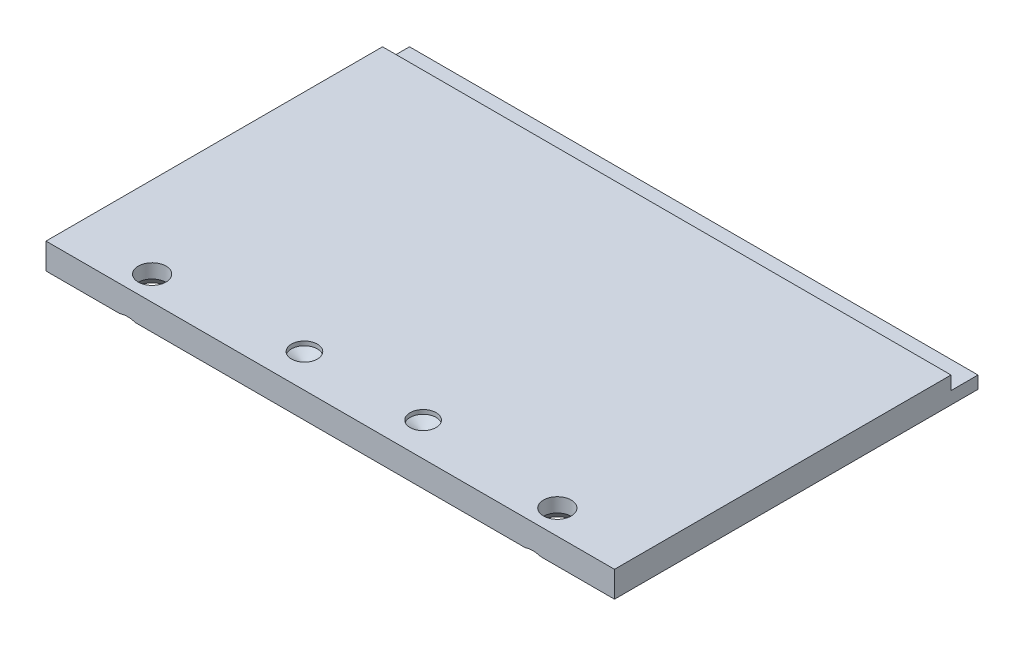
from build123d import *

# Parameters (mm, degrees)
SKETCH1_W                                       = 69.596
SKETCH1_H                                       = 44.5008
EXTRUDE1_DEPTH                                  = 3.175
CSK_FOR_M3_FLAT_HEAD_MACHINE_SCREW1_D           = 3.4
CSK_FOR_M3_FLAT_HEAD_MACHINE_SCREW1_CSINK_D     = 6.3
CSK_FOR_M3_FLAT_HEAD_MACHINE_SCREW1_CSINK_ANGLE = 90
EXTRUDE2_DEPTH                                  = 57.580055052
EXTRUDE2_DEPTH_BACK                             = 57.580055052
SKETCH4_W                                       = 9.778514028
SKETCH4_H                                       = 3.542827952
SKETCH5_R                                       = 0.059996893
EEL_LOGO_DEPTH                                  = 0.254
SKETCH6_W                                       = 0.427403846
SKETCH6_H                                       = 4.7625
EXTRUDE3_DEPTH                                  = 0.254
F_1_8_0_125_DIAMETER_HOLE1_D                    = 3.175
F_1_8_0_125_DIAMETER_HOLE1_DEPTH                = 0.508
F_1_8_0_125_DIAMETER_HOLE1_TIP                  = 0.953866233


with BuildPart() as part:
    # Sketch1 → Extrude1 (new body)
    with BuildSketch(Plane(origin=(0, 0, 0), x_dir=(1, 0, 0), z_dir=(0, 1, 0))):
        with Locations((0, 22.2504)):
            Rectangle(SKETCH1_W, SKETCH1_H)
    extrude(amount=EXTRUDE1_DEPTH)

    # CSK for M3 Flat Head Machine Screw1 (through all)
    with Locations(Plane.XZ):
        with Locations((24.8031, -2.9972), (-24.8031, -2.9972)):
            CounterSinkHole(CSK_FOR_M3_FLAT_HEAD_MACHINE_SCREW1_D / 2, CSK_FOR_M3_FLAT_HEAD_MACHINE_SCREW1_CSINK_D / 2, counter_sink_angle=CSK_FOR_M3_FLAT_HEAD_MACHINE_SCREW1_CSINK_ANGLE)

    # Sketch4 → Extrude2 (cut, two sides: drawn at the far end of the back side and taken through both)
    with BuildSketch(Plane(origin=(0, 0, 0), x_dir=(0, 0, -1), z_dir=(1, 0, 0)).offset(-EXTRUDE2_DEPTH_BACK)):
        with Locations((46.088057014, 3.295413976)):
            Rectangle(SKETCH4_W, SKETCH4_H)
    extrude(amount=EXTRUDE2_DEPTH + EXTRUDE2_DEPTH_BACK, mode=Mode.SUBTRACT)

    # Sketch5 → EEL Logo (cut)
    # profile 1 of 8: a face of its own
    with BuildSketch(Plane(origin=(-0.521180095, 0, -26.506166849), x_dir=(-1, 0, 0), z_dir=(0, -1, 0))):
        with BuildLine():
            Line((0.615540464, -3.590381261), (0.724625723, -3.44311616))
            Line((0.724625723, -3.44311616), (0.817348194, -3.432207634))
            Line((0.817348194, -3.432207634), (0.910070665, -3.44311616))
            Line((0.910070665, -3.44311616), (0.997338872, -3.475841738))
            Line((0.997338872, -3.475841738), (1.019155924, -3.535838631))
            Line((1.019155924, -3.535838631), (1.008247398, -3.69946652))
            Line((1.008247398, -3.69946652), (0.970067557, -3.846731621))
            Line((0.970067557, -3.846731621), (0.893707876, -4.01035951))
            Line((0.893707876, -4.01035951), (0.82825672, -4.184895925))
            Line((0.82825672, -4.184895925), (0.735534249, -4.348523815))
            Line((0.735534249, -4.348523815), (0.620994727, -4.512151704))
            Line((0.620994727, -4.512151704), (0.495546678, -4.648508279))
            Line((0.495546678, -4.648508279), (0.381007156, -4.795773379))
            Line((0.381007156, -4.795773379), (0.277376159, -4.904858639))
            Line((0.277376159, -4.904858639), (0.135565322, -5.079395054))
            Line((0.135565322, -5.079395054), (-0.028062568, -5.264839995))
            Line((-0.028062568, -5.264839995), (-0.158964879, -5.390288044))
            ThreePointArc((-0.158964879, -5.390288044), (-0.376321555, -5.592764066), (-0.598156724, -5.790323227))
            Line((-0.598156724, -5.790323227), (-0.821781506, -5.975768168))
            Line((-0.821781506, -5.975768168), (-0.979955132, -6.150304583))
            Line((-0.979955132, -6.150304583), (-1.203579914, -6.373929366))
            Line((-1.203579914, -6.373929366), (-1.356299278, -6.526648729))
            Line((-1.356299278, -6.526648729), (-1.519927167, -6.679368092))
            Line((-1.519927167, -6.679368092), (-1.661738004, -6.842995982))
            Line((-1.661738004, -6.842995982), (-1.825365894, -6.984806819))
            Line((-1.825365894, -6.984806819), (-1.967176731, -7.121163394))
            Line((-1.967176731, -7.121163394), (-2.070807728, -7.22479439))
            Line((-2.070807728, -7.22479439), (-2.245344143, -7.393876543))
            Line((-2.245344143, -7.393876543), (-2.381700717, -7.524778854))
            Line((-2.381700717, -7.524778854), (-2.463514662, -7.595684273))
            Line((-2.463514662, -7.595684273), (-2.6053255, -7.748403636))
            Line((-2.6053255, -7.748403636), (-2.741682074, -7.873851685))
            Line((-2.741682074, -7.873851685), (-2.86167586, -8.004753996))
            Line((-2.86167586, -8.004753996), (-2.987123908, -8.135656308))
            Line((-2.987123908, -8.135656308), (-3.085300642, -8.206561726))
            Line((-3.085300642, -8.206561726), (-3.161660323, -8.1956532))
            Line((-3.161660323, -8.1956532), (-3.052575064, -8.097476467))
            Line((-3.052575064, -8.097476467), (-2.867130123, -7.890214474))
            Line((-2.867130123, -7.890214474), (-2.654413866, -7.677498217))
            Line((-2.654413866, -7.677498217), (-2.485331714, -7.497507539))
            Line((-2.485331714, -7.497507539), (-2.299886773, -7.295699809))
            Line((-2.299886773, -7.295699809), (-2.087170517, -7.066620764))
            Line((-2.087170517, -7.066620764), (-1.896271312, -6.842995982))
            Line((-1.896271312, -6.842995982), (-1.716280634, -6.630279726))
            Line((-1.716280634, -6.630279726), (-1.536289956, -6.412109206))
            Line((-1.536289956, -6.412109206), (-1.383570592, -6.243027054))
            Line((-1.383570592, -6.243027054), (-1.198125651, -6.057582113))
            Line((-1.198125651, -6.057582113), (-1.034497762, -5.872137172))
            Line((-1.034497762, -5.872137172), (-0.827235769, -5.670329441))
            Line((-0.827235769, -5.670329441), (-0.674516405, -5.4848845))
            Line((-0.674516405, -5.4848845), (-0.549068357, -5.3376194))
            Line((-0.549068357, -5.3376194), (-0.418166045, -5.201262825))
            Line((-0.418166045, -5.201262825), (-0.30622998, -5.084849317))
            Line((-0.30622998, -5.084849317), (-0.218961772, -4.997581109))
            Line((-0.218961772, -4.997581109), (-0.14260209, -4.899404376))
            Line((-0.14260209, -4.899404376), (-0.055333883, -4.752139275))
            Line((-0.055333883, -4.752139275), (0.037388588, -4.615782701))
            Line((0.037388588, -4.615782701), (0.157382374, -4.446700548))
            Line((0.157382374, -4.446700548), (0.26101337, -4.304889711))
            Line((0.26101337, -4.304889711), (0.402824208, -4.070356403))
            Line((0.402824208, -4.070356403), (0.506455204, -3.912182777))
            Line((0.506455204, -3.912182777), (0.57190636, -3.775826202))
            Line((0.57190636, -3.775826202), (0.599177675, -3.655832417))
            Line((0.599177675, -3.655832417), (0.615540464, -3.590381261))
        make_face()
    # profile 2 of 8: a face of its own
    with BuildSketch(Plane(origin=(-0.521180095, 0, -26.506166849), x_dir=(-1, 0, 0), z_dir=(0, -1, 0))):
        Polygon((0.751897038, -0.868704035), (0.904616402, -0.84143272), (0.97552182, -0.808707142), (1.090061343, -0.803252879), (1.188238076, -0.814161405), (1.242780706, -0.906883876), (1.270052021, -1.108691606), (1.242780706, -1.255956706), (1.204600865, -1.403221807), (1.144603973, -1.539578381), (1.068244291, -1.692297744), (0.97552182, -1.899559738), (0.850073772, -2.025007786), (0.730079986, -2.139547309), (0.62644899, -2.264995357), (0.490092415, -2.384989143), (0.310101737, -2.543162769), (0.1682909, -2.668610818), (0.05920564, -2.761333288), (-0.060788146, -2.864964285), (-0.186236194, -2.974049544), (-0.360772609, -3.110406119), (-0.491674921, -3.257671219), (-0.628031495, -3.366756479), (-0.769842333, -3.475841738), (-0.906198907, -3.60674405), (-1.053464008, -3.743100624), (-1.178912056, -3.923091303), (-1.249817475, -4.092173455), (-1.298905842, -4.233984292), (-1.309814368, -4.364886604), (-1.293451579, -4.479426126), (-1.255271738, -4.561240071), (-1.211637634, -4.621236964), (-1.140732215, -4.659416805), (-1.097098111, -4.708505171), (-1.16800353, -4.735776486), (-1.228000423, -4.719413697), (-1.315268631, -4.653962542), (-1.407991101, -4.561240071), (-1.489805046, -4.452154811), (-1.571618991, -4.421094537), (-1.653432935, -4.299435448), (-1.669795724, -4.135807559), (-1.669795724, -4.004905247), (-1.664341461, -3.895819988), (-1.653432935, -3.770371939), (-1.620707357, -3.634015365), (-1.577073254, -3.503113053), (-1.53343915, -3.394027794), (-1.473442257, -3.268579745), (-1.358902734, -3.121314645), (-1.27708879, -3.006775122), (-1.173457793, -2.919506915), (-1.058918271, -2.799513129), (-0.982558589, -2.717699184), (-0.884381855, -2.614068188), (-0.802567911, -2.548617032), (-0.688028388, -2.439531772), (-0.529854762, -2.292266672), (-0.388043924, -2.161364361), (-0.273504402, -2.025007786), (-0.093513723, -1.872288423), (0.048297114, -1.741386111), (0.217379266, -1.577758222), (0.364644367, -1.430493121), (0.430095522, -1.321407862), (0.511909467, -1.212322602), (0.533726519, -1.081420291), (0.653720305, -0.955972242), align=None)
    # profile 3 of 8: a face of its own
    with BuildSketch(Plane(origin=(-0.521180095, 0, -26.506166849), x_dir=(-1, 0, 0), z_dir=(0, -1, 0))):
        with BuildLine():
            Line((1.230806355, -0.713683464), (1.144603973, -0.683259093))
            Line((1.144603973, -0.683259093), (1.051881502, -0.683259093))
            Line((1.051881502, -0.683259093), (0.942796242, -0.694167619))
            Line((0.942796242, -0.694167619), (0.800985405, -0.737801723))
            Line((0.800985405, -0.737801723), (0.670083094, -0.819615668))
            Line((0.670083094, -0.819615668), (0.533726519, -0.912338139))
            Line((0.533726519, -0.912338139), (0.381007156, -1.015969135))
            Line((0.381007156, -1.015969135), (0.228287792, -1.130508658))
            Line((0.228287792, -1.130508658), (0.108294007, -1.24504818))
            Line((0.108294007, -1.24504818), (-0.060788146, -1.386859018))
            Line((-0.060788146, -1.386859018), (-0.191690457, -1.506852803))
            Line((-0.191690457, -1.506852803), (-0.317138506, -1.632300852))
            Line((-0.317138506, -1.632300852), (-0.426223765, -1.785020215))
            Line((-0.426223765, -1.785020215), (-0.551671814, -1.932285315))
            Line((-0.551671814, -1.932285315), (-0.720753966, -2.101367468))
            Line((-0.720753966, -2.101367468), (-0.862564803, -2.254086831))
            Line((-0.862564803, -2.254086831), (-1.009829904, -2.401351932))
            Line((-1.009829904, -2.401351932), (-1.178912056, -2.570434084))
            Line((-1.178912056, -2.570434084), (-1.315268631, -2.695882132))
            Line((-1.315268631, -2.695882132), (-1.462533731, -2.854055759))
            Line((-1.462533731, -2.854055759), (-1.604344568, -2.995866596))
            Line((-1.604344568, -2.995866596), (-1.784335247, -3.143131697))
            Line((-1.784335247, -3.143131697), (-1.931600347, -3.268579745))
            Line((-1.931600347, -3.268579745), (-2.04613987, -3.361302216))
            Line((-2.04613987, -3.361302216), (-2.231584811, -3.454024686))
            Line((-2.231584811, -3.454024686), (-2.362487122, -3.372210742))
            Line((-2.362487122, -3.372210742), (-2.466118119, -3.257671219))
            Line((-2.466118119, -3.257671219), (-2.542477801, -3.143131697))
            Line((-2.542477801, -3.143131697), (-2.591566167, -3.012229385))
            Line((-2.591566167, -3.012229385), (-2.618837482, -2.897689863))
            Line((-2.618837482, -2.897689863), (-2.629746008, -2.78315034))
            Line((-2.629746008, -2.78315034), (-2.65156306, -2.641339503))
            Line((-2.65156306, -2.641339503), (-2.65156306, -2.460504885))
            Line((-2.65156306, -2.460504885), (-2.618837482, -2.341355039))
            Line((-2.618837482, -2.341355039), (-2.553386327, -2.281358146))
            Line((-2.553386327, -2.281358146), (-2.427938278, -2.243178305))
            Line((-2.427938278, -2.243178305), (-2.269764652, -2.183181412))
            Line((-2.269764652, -2.183181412), (-2.117045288, -2.085004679))
            Line((-2.117045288, -2.085004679), (-1.931600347, -1.926831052))
            Line((-1.931600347, -1.926831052), (-1.767972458, -1.785020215))
            Line((-1.767972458, -1.785020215), (-1.62616162, -1.648663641))
            Line((-1.62616162, -1.648663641), (-1.484350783, -1.517761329))
            Line((-1.484350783, -1.517761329), (-1.326177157, -1.375950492))
            Line((-1.326177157, -1.375950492), (-1.206183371, -1.24504818))
            Line((-1.206183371, -1.24504818), (-1.053464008, -1.114145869))
            Line((-1.053464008, -1.114145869), (-0.91165317, -0.972335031))
            Line((-0.91165317, -0.972335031), (-0.76438807, -0.84143272))
            Line((-0.76438807, -0.84143272), (-0.606214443, -0.721438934))
            Line((-0.606214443, -0.721438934), (-0.437132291, -0.623262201))
            Line((-0.437132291, -0.623262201), (-0.246233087, -0.53053973))
            Line((-0.246233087, -0.53053973), (-0.093513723, -0.454180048))
            Line((-0.093513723, -0.454180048), (0.081022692, -0.388728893))
            Line((0.081022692, -0.388728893), (0.310101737, -0.345094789))
            Line((0.310101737, -0.345094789), (0.473729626, -0.339640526))
            Line((0.473729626, -0.339640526), (0.740988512, -0.405091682))
            Line((0.740988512, -0.405091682), (0.931887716, -0.410545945))
            Line((0.931887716, -0.410545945), (1.100969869, -0.459634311))
            Line((1.100969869, -0.459634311), (1.204600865, -0.579628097))
            Line((1.204600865, -0.579628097), (1.242780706, -0.645079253))
            Line((1.242780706, -0.645079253), (1.237856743, -0.709090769))
            ThreePointArc((1.237856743, -0.709090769), (1.235464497, -0.71312634), (1.230806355, -0.713683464))
        make_face()
    # profile 4 of 8: a face of its own
    with BuildSketch(Plane(origin=(-0.521180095, 0, -26.506166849), x_dir=(-1, 0, 0), z_dir=(0, -1, 0))):
        with BuildLine():
            Line((-3.431522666, -2.630430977), (-3.524245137, -2.395897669))
            Line((-3.524245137, -2.395897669), (-3.589696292, -2.112275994))
            Line((-3.589696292, -2.112275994), (-3.627876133, -1.883196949))
            Line((-3.627876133, -1.883196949), (-3.660601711, -1.626846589))
            ThreePointArc((-3.660601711, -1.626846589), (-3.684953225, -1.384676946), (-3.6769645, -1.141417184))
            Line((-3.6769645, -1.141417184), (-3.62242187, -0.901429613))
            Line((-3.62242187, -0.901429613), (-3.562424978, -0.655987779))
            Line((-3.562424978, -0.655987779), (-3.469702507, -0.377820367))
            Line((-3.469702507, -0.377820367), (-3.393342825, -0.159649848))
            ThreePointArc((-3.393342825, -0.159649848), (-3.184980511, 0.225184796), (-2.924276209, 0.576675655))
            Line((-2.924276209, 0.576675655), (-2.826099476, 0.685760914))
            Line((-2.826099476, 0.685760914), (-2.738831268, 0.789391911))
            Line((-2.738831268, 0.789391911), (-2.624291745, 0.931202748))
            Line((-2.624291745, 0.931202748), (-2.526115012, 1.040288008))
            Line((-2.526115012, 1.040288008), (-2.427938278, 1.15482753))
            Line((-2.427938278, 1.15482753), (-2.307944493, 1.253004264))
            Line((-2.307944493, 1.253004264), (-2.177042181, 1.35663526))
            Line((-2.177042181, 1.35663526), (-2.057048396, 1.460266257))
            Line((-2.057048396, 1.460266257), (-1.898874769, 1.57480578))
            Line((-1.898874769, 1.57480578), (-1.767972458, 1.651165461))
            Line((-1.767972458, 1.651165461), (-1.647978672, 1.683891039))
            Line((-1.647978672, 1.683891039), (-1.538893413, 1.72207088))
            Line((-1.538893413, 1.72207088), (-1.429808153, 1.749342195))
            Line((-1.429808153, 1.749342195), (-1.358902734, 1.765704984))
            Line((-1.358902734, 1.765704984), (-1.238908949, 1.782067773))
            Line((-1.238908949, 1.782067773), (-1.140732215, 1.775780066))
            Line((-1.140732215, 1.775780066), (-1.058918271, 1.754796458))
            Line((-1.058918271, 1.754796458), (-0.971650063, 1.820247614))
            Line((-0.971650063, 1.820247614), (-0.873473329, 1.896607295))
            Line((-0.873473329, 1.896607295), (-0.791659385, 1.956604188))
            Line((-0.791659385, 1.956604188), (-0.720753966, 2.016601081))
            Line((-0.720753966, 2.016601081), (-0.622577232, 2.087506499))
            Line((-0.622577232, 2.087506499), (-0.557126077, 2.147503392))
            Line((-0.557126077, 2.147503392), (-0.486220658, 2.191137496))
            Line((-0.486220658, 2.191137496), (-0.388043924, 2.262042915))
            Line((-0.388043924, 2.262042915), (-0.311684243, 2.305677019))
            Line((-0.311684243, 2.305677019), (-0.240778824, 2.360219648))
            Line((-0.240778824, 2.360219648), (-0.14260209, 2.425670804))
            Line((-0.14260209, 2.425670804), (-0.04987962, 2.485667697))
            Line((-0.04987962, 2.485667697), (0.031934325, 2.54566459))
            Line((0.031934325, 2.54566459), (0.141019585, 2.622024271))
            Line((0.141019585, 2.622024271), (0.222833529, 2.671112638))
            Line((0.222833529, 2.671112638), (0.310101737, 2.731109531))
            Line((0.310101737, 2.731109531), (0.375552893, 2.763835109))
            Line((0.375552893, 2.763835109), (0.430095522, 2.80201495))
            Line((0.430095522, 2.80201495), (0.533726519, 2.856557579))
            Line((0.533726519, 2.856557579), (0.637357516, 2.905645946))
            Line((0.637357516, 2.905645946), (0.740988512, 2.971097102))
            Line((0.740988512, 2.971097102), (0.811893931, 3.009276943))
            Line((0.811893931, 3.009276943), (0.899162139, 3.05836531))
            Line((0.899162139, 3.05836531), (0.964613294, 3.085636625))
            Line((0.964613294, 3.085636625), (1.035518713, 3.118362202))
            Line((1.035518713, 3.118362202), (1.106424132, 3.15108778))
            Line((1.106424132, 3.15108778), (1.193692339, 3.178359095))
            Line((1.193692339, 3.178359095), (1.253689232, 3.20563041))
            Line((1.253689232, 3.20563041), (1.324594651, 3.227447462))
            Line((1.324594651, 3.227447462), (1.406408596, 3.254718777))
            Line((1.406408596, 3.254718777), (1.460951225, 3.26017304))
            Line((1.460951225, 3.26017304), (1.537310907, 3.276535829))
            Line((1.537310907, 3.276535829), (1.635487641, 3.292898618))
            Line((1.635487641, 3.292898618), (1.700938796, 3.303807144))
            Line((1.700938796, 3.303807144), (1.804569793, 3.31471567))
            Line((1.804569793, 3.31471567), (1.886383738, 3.320169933))
            Line((1.886383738, 3.320169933), (1.951834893, 3.298352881))
            Line((1.951834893, 3.298352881), (2.017286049, 3.287444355))
            Line((2.017286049, 3.287444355), (2.077282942, 3.287444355))
            Line((2.077282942, 3.287444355), (2.142734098, 3.298352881))
            Line((2.142734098, 3.298352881), (2.213639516, 3.298352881))
            Line((2.213639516, 3.298352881), (2.279090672, 3.298352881))
            Line((2.279090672, 3.298352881), (2.349996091, 3.287444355))
            Line((2.349996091, 3.287444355), (2.409992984, 3.265627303))
            Line((2.409992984, 3.265627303), (2.431810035, 3.232901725))
            Line((2.431810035, 3.232901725), (2.393630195, 3.167450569))
            Line((2.393630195, 3.167450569), (2.355450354, 3.145633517))
            Line((2.355450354, 3.145633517), (2.300907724, 3.112907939))
            Line((2.300907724, 3.112907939), (2.262727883, 3.00382268))
            Line((2.262727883, 3.00382268), (2.197276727, 2.89473742))
            Line((2.197276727, 2.89473742), (2.082737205, 2.780197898))
            Line((2.082737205, 2.780197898), (2.022740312, 2.632932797))
            Line((2.022740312, 2.632932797), (1.984560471, 2.507484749))
            Line((1.984560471, 2.507484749), (1.935472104, 2.371128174))
            Line((1.935472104, 2.371128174), (1.886383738, 2.218408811))
            Line((1.886383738, 2.218408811), (1.870020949, 2.103869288))
            Line((1.870020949, 2.103869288), (1.7445729, 1.929332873))
            Line((1.7445729, 1.929332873), (1.630033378, 1.787522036))
            Line((1.630033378, 1.787522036), (1.499131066, 1.640256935))
            Line((1.499131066, 1.640256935), (1.351865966, 1.509354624))
            Line((1.351865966, 1.509354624), (1.237326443, 1.416632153))
            Line((1.237326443, 1.416632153), (1.100969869, 1.291184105))
            Line((1.100969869, 1.291184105), (0.997338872, 1.20937016))
            Line((0.997338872, 1.20937016), (0.904616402, 1.127556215))
            Line((0.904616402, 1.127556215), (0.82825672, 1.073013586))
            Line((0.82825672, 1.073013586), (0.730079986, 1.06210506))
            Line((0.730079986, 1.06210506), (0.82825672, 1.176644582))
            Line((0.82825672, 1.176644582), (0.915524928, 1.242095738))
            Line((0.915524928, 1.242095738), (1.002793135, 1.329363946))
            Line((1.002793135, 1.329363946), (1.117332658, 1.422086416))
            Line((1.117332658, 1.422086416), (1.23187218, 1.52026315))
            Line((1.23187218, 1.52026315), (1.330048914, 1.596622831))
            Line((1.330048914, 1.596622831), (1.428225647, 1.689345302))
            Line((1.428225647, 1.689345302), (1.526402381, 1.792976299))
            Line((1.526402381, 1.792976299), (1.608216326, 1.891153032))
            Line((1.608216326, 1.891153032), (1.679121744, 1.989329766))
            Line((1.679121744, 1.989329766), (1.733664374, 2.120232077))
            Line((1.733664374, 2.120232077), (1.771844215, 2.229317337))
            Line((1.771844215, 2.229317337), (1.793661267, 2.322039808))
            Line((1.793661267, 2.322039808), (1.820932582, 2.414762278))
            Line((1.820932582, 2.414762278), (1.864566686, 2.49112196))
            Line((1.864566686, 2.49112196), (1.891838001, 2.562027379))
            Line((1.891838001, 2.562027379), (1.962743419, 2.687475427))
            Line((1.962743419, 2.687475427), (2.006377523, 2.774743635))
            Line((2.006377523, 2.774743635), (2.071828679, 2.856557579))
            Line((2.071828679, 2.856557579), (2.131825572, 2.965642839))
            Line((2.131825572, 2.965642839), (2.197276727, 3.052911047))
            Line((2.197276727, 3.052911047), (2.191822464, 3.101999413))
            Line((2.191822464, 3.101999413), (2.131825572, 3.063819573))
            Line((2.131825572, 3.063819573), (2.082737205, 3.025639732))
            Line((2.082737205, 3.025639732), (2.028194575, 2.94928005))
            Line((2.028194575, 2.94928005), (1.979106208, 2.889283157))
            Line((1.979106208, 2.889283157), (1.913655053, 2.807469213))
            Line((1.913655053, 2.807469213), (1.842749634, 2.720201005))
            Line((1.842749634, 2.720201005), (1.793661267, 2.600207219))
            Line((1.793661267, 2.600207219), (1.717301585, 2.512939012))
            Line((1.717301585, 2.512939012), (1.657304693, 2.403853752))
            Line((1.657304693, 2.403853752), (1.5973078, 2.294768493))
            Line((1.5973078, 2.294768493), (1.510039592, 2.196591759))
            Line((1.510039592, 2.196591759), (1.411862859, 2.092960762))
            Line((1.411862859, 2.092960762), (1.313686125, 2.005692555))
            Line((1.313686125, 2.005692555), (1.226417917, 1.934787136))
            Line((1.226417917, 1.934787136), (1.13914971, 1.874790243))
            Line((1.13914971, 1.874790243), (1.057335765, 1.809339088))
            Line((1.057335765, 1.809339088), (0.959159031, 1.72207088))
            Line((0.959159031, 1.72207088), (0.866436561, 1.651165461))
            Line((0.866436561, 1.651165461), (0.680991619, 1.514808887))
            Line((0.680991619, 1.514808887), (0.615540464, 1.443903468))
            Line((0.615540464, 1.443903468), (0.51736373, 1.362089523))
            Line((0.51736373, 1.362089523), (0.391915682, 1.258458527))
            Line((0.391915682, 1.258458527), (0.228287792, 1.138464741))
            Line((0.228287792, 1.138464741), (0.141019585, 1.045742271))
            Line((0.141019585, 1.045742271), (0.00466301, 0.936657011))
            Line((0.00466301, 0.936657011), (-0.082605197, 0.865751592))
            Line((-0.082605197, 0.865751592), (-0.164419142, 0.789391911))
            Line((-0.164419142, 0.789391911), (-0.229870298, 0.718486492))
            Line((-0.229870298, 0.718486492), (-0.308731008, 0.683984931))
            ThreePointArc((-0.308731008, 0.683984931), (-0.313998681, 0.684572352), (-0.316125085, 0.689427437))
            Line((-0.316125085, 0.689427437), (-0.311684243, 0.729395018))
            Line((-0.311684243, 0.729395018), (-0.273504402, 0.800300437))
            Line((-0.273504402, 0.800300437), (-0.235324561, 0.893022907))
            Line((-0.235324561, 0.893022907), (-0.191690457, 0.980291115))
            Line((-0.191690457, 0.980291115), (-0.158964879, 1.094830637))
            Line((-0.158964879, 1.094830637), (-0.126239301, 1.203915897))
            Line((-0.126239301, 1.203915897), (-0.098967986, 1.313001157))
            Line((-0.098967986, 1.313001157), (-0.077150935, 1.405723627))
            Line((-0.077150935, 1.405723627), (-0.060788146, 1.482083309))
            Line((-0.060788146, 1.482083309), (-0.088650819, 1.509945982))
            ThreePointArc((-0.088650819, 1.509945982), (-0.093079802, 1.511454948), (-0.096978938, 1.508868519))
            Line((-0.096978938, 1.508868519), (-0.131693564, 1.449357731))
            Line((-0.131693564, 1.449357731), (-0.175327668, 1.383906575))
            Line((-0.175327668, 1.383906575), (-0.213507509, 1.31845542))
            Line((-0.213507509, 1.31845542), (-0.246233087, 1.258458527))
            Line((-0.246233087, 1.258458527), (-0.278958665, 1.187553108))
            Line((-0.278958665, 1.187553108), (-0.328047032, 1.1002849))
            Line((-0.328047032, 1.1002849), (-0.355318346, 1.029379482))
            Line((-0.355318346, 1.029379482), (-0.405600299, 0.953956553))
            ThreePointArc((-0.405600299, 0.953956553), (-0.409925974, 0.951596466), (-0.414325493, 0.953815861))
            Line((-0.414325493, 0.953815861), (-0.437132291, 0.985745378))
            Line((-0.437132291, 0.985745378), (-0.448040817, 1.029379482))
            Line((-0.448040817, 1.029379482), (-0.475312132, 1.105739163))
            Line((-0.475312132, 1.105739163), (-0.475312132, 1.187553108))
            Line((-0.475312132, 1.187553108), (-0.475312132, 1.258458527))
            Line((-0.475312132, 1.258458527), (-0.480766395, 1.351180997))
            Line((-0.480766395, 1.351180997), (-0.469857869, 1.416632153))
            Line((-0.469857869, 1.416632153), (-0.492252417, 1.483815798))
            ThreePointArc((-0.492252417, 1.483815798), (-0.498131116, 1.48737239), (-0.502583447, 1.482139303))
            Line((-0.502583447, 1.482139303), (-0.502583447, 1.46572052))
            Line((-0.502583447, 1.46572052), (-0.518946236, 1.416632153))
            Line((-0.518946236, 1.416632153), (-0.535309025, 1.351180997))
            Line((-0.535309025, 1.351180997), (-0.557126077, 1.285729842))
            Line((-0.557126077, 1.285729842), (-0.56258034, 1.20937016))
            Line((-0.56258034, 1.20937016), (-0.568034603, 1.149373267))
            Line((-0.568034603, 1.149373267), (-0.56258034, 1.078467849))
            Line((-0.56258034, 1.078467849), (-0.557126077, 1.013016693))
            Line((-0.557126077, 1.013016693), (-0.529854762, 0.931202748))
            Line((-0.529854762, 0.931202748), (-0.524400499, 0.871205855))
            Line((-0.524400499, 0.871205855), (-0.540763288, 0.778483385))
            Line((-0.540763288, 0.778483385), (-0.606214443, 0.729395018))
            Line((-0.606214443, 0.729395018), (-0.677119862, 0.658489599))
            Line((-0.677119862, 0.658489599), (-0.720753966, 0.582129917))
            Line((-0.720753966, 0.582129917), (-0.737116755, 0.478498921))
            Line((-0.737116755, 0.478498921), (-0.758933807, 0.402139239))
            Line((-0.758933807, 0.402139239), (-0.76438807, 0.320325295))
            Line((-0.76438807, 0.320325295), (-0.791659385, 0.243965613))
            Line((-0.791659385, 0.243965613), (-0.797113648, 0.167605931))
            Line((-0.797113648, 0.167605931), (-0.8189307, 0.080337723))
            Line((-0.8189307, 0.080337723), (-0.862564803, 0.003978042))
            Line((-0.862564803, 0.003978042), (-0.906198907, -0.07238164))
            Line((-0.906198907, -0.07238164), (-0.971650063, -0.132378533))
            Line((-0.971650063, -0.132378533), (-1.058918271, -0.214192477))
            Line((-1.058918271, -0.214192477), (-1.157095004, -0.279643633))
            Line((-1.157095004, -0.279643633), (-1.266180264, -0.328732))
            Line((-1.266180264, -0.328732), (-1.36981126, -0.361457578))
            Line((-1.36981126, -0.361457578), (-1.495259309, -0.426908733))
            Line((-1.495259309, -0.426908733), (-1.609798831, -0.492359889))
            Line((-1.609798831, -0.492359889), (-1.718884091, -0.563265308))
            Line((-1.718884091, -0.563265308), (-1.778880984, -0.683259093))
            Line((-1.778880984, -0.683259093), (-1.811606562, -0.814161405))
            Line((-1.811606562, -0.814161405), (-1.838877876, -0.950517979))
            Line((-1.838877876, -0.950517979), (-1.860694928, -1.081420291))
            Line((-1.860694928, -1.081420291), (-1.88251198, -1.217776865))
            Line((-1.88251198, -1.217776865), (-1.931600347, -1.359587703))
            Line((-1.931600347, -1.359587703), (-2.013414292, -1.495944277))
            Line((-2.013414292, -1.495944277), (-2.117045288, -1.621392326))
            Line((-2.117045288, -1.621392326), (-2.242493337, -1.719569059))
            Line((-2.242493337, -1.719569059), (-2.362487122, -1.817745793))
            Line((-2.362487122, -1.817745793), (-2.477026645, -1.877742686))
            Line((-2.477026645, -1.877742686), (-2.586111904, -2.01409926))
            Line((-2.586111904, -2.01409926), (-2.689742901, -2.183181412))
            Line((-2.689742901, -2.183181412), (-2.749739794, -2.417714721))
            Line((-2.749739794, -2.417714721), (-2.782465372, -2.695882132))
            Line((-2.782465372, -2.695882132), (-2.777011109, -2.875872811))
            Line((-2.777011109, -2.875872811), (-2.749739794, -3.061317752))
            Line((-2.749739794, -3.061317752), (-2.657017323, -3.224945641))
            Line((-2.657017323, -3.224945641), (-2.569749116, -3.366756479))
            Line((-2.569749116, -3.366756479), (-2.460663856, -3.459478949))
            Line((-2.460663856, -3.459478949), (-2.34067007, -3.530384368))
            Line((-2.34067007, -3.530384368), (-2.427938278, -3.579472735))
            Line((-2.427938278, -3.579472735), (-2.55884059, -3.563109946))
            Line((-2.55884059, -3.563109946), (-2.695197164, -3.508567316))
            Line((-2.695197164, -3.508567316), (-2.85337079, -3.388573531))
            Line((-2.85337079, -3.388573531), (-2.973364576, -3.274034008))
            Line((-2.973364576, -3.274034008), (-3.066087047, -3.175857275))
            Line((-3.066087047, -3.175857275), (-3.196989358, -3.006775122))
            Line((-3.196989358, -3.006775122), (-3.431522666, -2.630430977))
        make_face()
        with Locations(Location((1.804569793, 3.031093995, 0), (0, 0, 90))):
            Circle(SKETCH5_R, mode=Mode.SUBTRACT)
    # profile 5 of 8: a face of its own
    with BuildSketch(Plane(origin=(-0.521180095, 0, -26.506166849), x_dir=(-1, 0, 0), z_dir=(0, -1, 0))):
        Polygon((-1.042555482, -3.993996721), (-0.884381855, -3.966725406), (-0.726208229, -3.884911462), (-0.617122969, -3.797643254), (-0.45349508, -3.644923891), (-0.273504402, -3.470387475), (-0.077150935, -3.339485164), (0.037388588, -3.224945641), (0.228287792, -3.110406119), (0.359190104, -3.044954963), (0.490092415, -3.006775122), (0.620994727, -2.995866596), (0.713717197, -3.012229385), (0.82825672, -3.121314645), (0.931887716, -3.203128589), (0.97552182, -3.257671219), (1.013701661, -3.334030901), (0.970067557, -3.328576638), (0.88279935, -3.290396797), (0.779168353, -3.323122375), (0.675537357, -3.361302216), (0.555543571, -3.432207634), (0.419186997, -3.546747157), (0.288284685, -3.644923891), (0.151928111, -3.770371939), (0.031934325, -3.906728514), (-0.120785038, -4.043085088), (-0.284412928, -4.195804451), (-0.437132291, -4.326706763), (-0.573488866, -4.435792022), (-0.666211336, -4.495788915), (-0.802567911, -4.599419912), (-0.91165317, -4.653962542), (-1.009829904, -4.637599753), (-1.07528106, -4.555785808), (-1.140732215, -4.463063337), (-1.184366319, -4.381249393), (-1.16800353, -4.239438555), (-1.118915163, -4.135807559), align=None)
    # profile 6 of 8: a face of its own
    with BuildSketch(Plane(origin=(-0.521180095, 0, -26.506166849), x_dir=(-1, 0, 0), z_dir=(0, -1, 0))):
        with BuildLine():
            Line((2.699068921, 0.876660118), (2.633617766, 0.914839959))
            Line((2.633617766, 0.914839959), (2.589983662, 0.84393454))
            Line((2.589983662, 0.84393454), (2.524532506, 0.8057547))
            Line((2.524532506, 0.8057547), (2.453627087, 0.800300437))
            Line((2.453627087, 0.800300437), (2.393630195, 0.778483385))
            Line((2.393630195, 0.778483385), (2.322724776, 0.865751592))
            Line((2.322724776, 0.865751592), (2.284544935, 0.773029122))
            Line((2.284544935, 0.773029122), (2.153642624, 0.75121207))
            Line((2.153642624, 0.75121207), (2.05546589, 0.75121207))
            Line((2.05546589, 0.75121207), (2.00092326, 0.75121207))
            Line((2.00092326, 0.75121207), (1.957289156, 0.865751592))
            Line((1.957289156, 0.865751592), (1.90820079, 0.762120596))
            Line((1.90820079, 0.762120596), (1.826386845, 0.75121207))
            Line((1.826386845, 0.75121207), (1.733664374, 0.75121207))
            Line((1.733664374, 0.75121207), (1.624579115, 0.756666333))
            Line((1.624579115, 0.756666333), (1.570036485, 0.756666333))
            Line((1.570036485, 0.756666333), (1.531856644, 0.854843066))
            Line((1.531856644, 0.854843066), (1.482768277, 0.783937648))
            Line((1.482768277, 0.783937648), (1.400954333, 0.794846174))
            Line((1.400954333, 0.794846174), (1.291869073, 0.800300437))
            Line((1.291869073, 0.800300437), (1.177329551, 0.783937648))
            Line((1.177329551, 0.783937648), (1.166421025, 0.876660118))
            Line((1.166421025, 0.876660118), (1.117332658, 0.822117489))
            Line((1.117332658, 0.822117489), (1.03006445, 0.816663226))
            Line((1.03006445, 0.816663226), (0.920979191, 0.838480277))
            Line((0.920979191, 0.838480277), (0.860982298, 0.849388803))
            Line((0.860982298, 0.849388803), (0.806439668, 0.942111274))
            Line((0.806439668, 0.942111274), (0.746442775, 0.89847717))
            Line((0.746442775, 0.89847717), (0.653720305, 0.914839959))
            Line((0.653720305, 0.914839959), (0.544635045, 0.942111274))
            Line((0.544635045, 0.942111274), (0.430095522, 0.980291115))
            Line((0.430095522, 0.980291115), (0.359190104, 1.00756243))
            Line((0.359190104, 1.00756243), (0.26101337, 0.936657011))
            Line((0.26101337, 0.936657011), (0.195562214, 0.882114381))
            Line((0.195562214, 0.882114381), (0.130111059, 0.827571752))
            Line((0.130111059, 0.827571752), (0.064659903, 0.773029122))
            Line((0.064659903, 0.773029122), (-0.011699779, 0.713032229))
            Line((-0.011699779, 0.713032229), (-0.093513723, 0.680306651))
            Line((-0.093513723, 0.680306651), (-0.157515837, 0.650767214))
            ThreePointArc((-0.157515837, 0.650767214), (-0.160513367, 0.646884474), (-0.159042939, 0.64220487))
            Line((-0.159042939, 0.64220487), (-0.098967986, 0.582129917))
            Line((-0.098967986, 0.582129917), (-0.011699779, 0.571221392))
            Line((-0.011699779, 0.571221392), (0.146473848, 0.54940434))
            Line((0.146473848, 0.54940434), (0.304647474, 0.522133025))
            Line((0.304647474, 0.522133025), (0.539180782, 0.483953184))
            Line((0.539180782, 0.483953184), (0.817348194, 0.462136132))
            Line((0.817348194, 0.462136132), (1.062790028, 0.44031908))
            Line((1.062790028, 0.44031908), (1.270052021, 0.434864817))
            Line((1.270052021, 0.434864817), (1.455496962, 0.445773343))
            Line((1.455496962, 0.445773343), (1.534063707, 0.445773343))
            ThreePointArc((1.534063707, 0.445773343), (1.539181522, 0.441855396), (1.536735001, 0.435892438))
            Line((1.536735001, 0.435892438), (1.422771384, 0.369413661))
            Line((1.422771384, 0.369413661), (1.297323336, 0.347596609))
            Line((1.297323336, 0.347596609), (1.144603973, 0.320325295))
            Line((1.144603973, 0.320325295), (1.008247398, 0.298508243))
            Line((1.008247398, 0.298508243), (0.817348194, 0.303962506))
            Line((0.817348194, 0.303962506), (0.730079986, 0.303962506))
            Line((0.730079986, 0.303962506), (0.588269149, 0.303962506))
            Line((0.588269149, 0.303962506), (0.525987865, 0.308575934))
            Line((0.525987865, 0.308575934), (0.441004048, 0.314871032))
            Line((0.441004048, 0.314871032), (0.315556, 0.325779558))
            Line((0.315556, 0.325779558), (0.1682909, 0.342142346))
            Line((0.1682909, 0.342142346), (0.015571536, 0.396684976))
            Line((0.015571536, 0.396684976), (-0.071696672, 0.451227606))
            Line((-0.071696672, 0.451227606), (-0.176455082, 0.465512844))
            ThreePointArc((-0.176455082, 0.465512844), (-0.181903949, 0.462649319), (-0.180972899, 0.456564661))
            Line((-0.180972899, 0.456564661), (-0.071696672, 0.344146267))
            Line((-0.071696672, 0.344146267), (0.015571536, 0.289603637))
            Line((0.015571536, 0.289603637), (0.1682909, 0.235061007))
            Line((0.1682909, 0.235061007), (0.315556, 0.218698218))
            Line((0.315556, 0.218698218), (0.441004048, 0.207789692))
            Line((0.441004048, 0.207789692), (0.525987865, 0.201494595))
            Line((0.525987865, 0.201494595), (0.730079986, 0.196881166))
            Line((0.730079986, 0.196881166), (0.817348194, 0.196881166))
            Line((0.817348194, 0.196881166), (1.008247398, 0.191426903))
            Line((1.008247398, 0.191426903), (1.144603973, 0.213243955))
            Line((1.144603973, 0.213243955), (1.297323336, 0.24051527))
            Line((1.297323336, 0.24051527), (1.422771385, 0.262332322))
            ThreePointArc((1.422771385, 0.262332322), (1.586334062, 0.305214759), (1.750027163, 0.347596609))
            Line((1.750027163, 0.347596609), (1.886383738, 0.38577645))
            Line((1.886383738, 0.38577645), (2.066374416, 0.423956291))
            Line((2.066374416, 0.423956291), (2.208185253, 0.489407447))
            Line((2.208185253, 0.489407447), (2.404538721, 0.565767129))
            Line((2.404538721, 0.565767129), (2.508169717, 0.625764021))
            Line((2.508169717, 0.625764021), (2.611800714, 0.69666944))
            Line((2.611800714, 0.69666944), (2.693614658, 0.778483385))
            Line((2.693614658, 0.778483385), (2.737248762, 0.822117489))
            Line((2.737248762, 0.822117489), (2.731790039, 0.8575728))
            Line((2.731790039, 0.8575728), (2.699068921, 0.876660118))
        make_face()
    # profile 7 of 8: a face of its own
    with BuildSketch(Plane(origin=(-0.521180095, 0, -26.506166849), x_dir=(-1, 0, 0), z_dir=(0, -1, 0))):
        with BuildLine():
            Line((8.351686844, -0.732907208), (10.236915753, 1.152321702))
            ThreePointArc((10.236915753, 1.152321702), (11.730811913, 2.309101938), (13.474150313, 3.037550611))
            ThreePointArc((13.474150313, 3.037550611), (11.433993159, 2.404792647), (9.703692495, 1.152321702))
            Line((9.703692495, 1.152321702), (8.195509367, -0.355861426))
            Line((8.195509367, -0.355861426), (7.662286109, -0.355861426))
            Line((7.662286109, -0.355861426), (7.285240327, -0.732907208))
            Line((7.285240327, -0.732907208), (3.89182829, -4.126319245))
            Line((3.89182829, -4.126319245), (3.358605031, -4.126319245))
            Line((3.358605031, -4.126319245), (-0.255675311, -7.740599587))
            Line((-0.255675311, -7.740599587), (-1.273291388, -6.72298351))
            Line((-1.273291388, -6.72298351), (-1.482550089, -7.046948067))
            Line((-1.482550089, -7.046948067), (-0.255675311, -8.273822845))
            Line((-0.255675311, -8.273822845), (3.514782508, -4.503365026))
            Line((3.514782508, -4.503365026), (4.048005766, -4.503365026))
            Line((4.048005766, -4.503365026), (7.818463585, -0.732907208))
            Line((7.818463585, -0.732907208), (8.351686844, -0.732907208))
        make_face()
    # profile 8 of 8: a face of its own
    with BuildSketch(Plane(origin=(-0.521180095, 0, -26.506166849), x_dir=(-1, 0, 0), z_dir=(0, -1, 0))):
        with BuildLine():
            Line((-6.341824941, -2.295174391), (-9.777079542, 1.055872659))
            ThreePointArc((-9.777079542, 1.055872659), (-11.45345724, 2.345711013), (-13.452277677, 3.037550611))
            ThreePointArc((-13.452277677, 3.037550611), (-11.708939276, 2.309101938), (-10.215043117, 1.152321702))
            Line((-10.215043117, 1.152321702), (-6.444585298, -2.618136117))
            Line((-6.444585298, -2.618136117), (-5.911362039, -2.618136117))
            Line((-5.911362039, -2.618136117), (-1.95630476, -6.573193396))
            Line((-1.95630476, -6.573193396), (-1.747587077, -6.250066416))
            Line((-1.747587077, -6.250066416), (-5.808642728, -2.288558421))
            Line((-5.808642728, -2.288558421), (-6.341824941, -2.295174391))
        make_face()
    extrude(amount=-EEL_LOGO_DEPTH, mode=Mode.SUBTRACT)

    # Sketch6 → Extrude3 (cut)
    # profile 1 of 9: a face of its own
    with BuildSketch(Plane.XZ):
        Polygon((30.462903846, -17.4625), (29.834200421, -22.225), (29.773142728, -22.225), (27.806894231, -18.317307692), (25.845415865, -22.225), (25.783404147, -22.225), (25.150884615, -17.4625), (25.580196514, -17.4625), (26.036221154, -20.889362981), (27.755376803, -17.4625), (27.851733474, -17.4625), (29.577567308, -20.896995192), (30.032637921, -17.4625), align=None)
    # profile 2 of 9: a face of its own
    with BuildSketch(Plane.XZ):
        with BuildLine():
            Line((24.173961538, -22.225), (23.244739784, -22.225))
            add(Edge.make_bspline(
                [(23.244739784, -22.225), (23.199252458, -22.224764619), (23.111086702, -22.224308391), (22.98289071, -22.217068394), (22.862775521, -22.207443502), (22.750953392, -22.191298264), (22.646696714, -22.174557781), (22.551063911, -22.149986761), (22.463253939, -22.122847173), (22.357812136, -22.081089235), (22.238173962, -22.01623863), (22.109585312, -21.92005902), (21.997808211, -21.804747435), (21.902764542, -21.673340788), (21.826489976, -21.528778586), (21.772006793, -21.37417113), (21.737004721, -21.212119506), (21.733450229, -21.101018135), (21.731653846, -21.044869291)],
                knots=[0, 0, 0, 0, 1.00128172, 1.940733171, 2.826250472, 3.653024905, 4.427672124, 5.149348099, 5.824709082, 6.450061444, 7.643590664, 8.808605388, 9.972104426, 11.165284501, 12.367876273, 13.557044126, 14.765369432, 16, 16, 16, 16], degree=3))
            add(Edge.make_bspline(
                [(21.731653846, -21.044869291), (21.733121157, -20.992267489), (21.736004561, -20.888899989), (21.764173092, -20.738219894), (21.806692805, -20.59433391), (21.868051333, -20.458628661), (21.946288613, -20.332296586), (22.04147602, -20.217492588), (22.154342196, -20.116470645), (22.239082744, -20.060250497), (22.282127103, -20.031693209)],
                knots=[0, 0, 0, 0, 1.044356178, 2.052258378, 3.035953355, 4.020338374, 5.002448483, 5.980768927, 6.974322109, 8, 8, 8, 8], degree=3))
            add(Edge.make_bspline(
                [(22.282127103, -20.031693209), (22.228020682, -20.01093122), (22.124501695, -19.971208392), (21.981861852, -19.90070689), (21.858926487, -19.824613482), (21.7541113, -19.742370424), (21.66628358, -19.651292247), (21.588043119, -19.553777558), (21.521642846, -19.446430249), (21.464988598, -19.331576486), (21.420109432, -19.209824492), (21.38895705, -19.082085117), (21.369200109, -18.949805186), (21.366616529, -18.859900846), (21.365307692, -18.814355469)],
                knots=[0, 0, 0, 0, 1.272200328, 2.434034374, 3.488177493, 4.442517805, 5.351202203, 6.260825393, 7.183200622, 8.11705787, 9.069326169, 10.026320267, 11.000137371, 12, 12, 12, 12], degree=3))
            add(Edge.make_bspline(
                [(21.365307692, -18.814355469), (21.366637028, -18.767864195), (21.369252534, -18.676391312), (21.388545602, -18.542012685), (21.421221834, -18.413599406), (21.466197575, -18.290296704), (21.524825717, -18.172826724), (21.595654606, -18.060266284), (21.680664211, -17.954283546), (21.776393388, -17.85334057), (21.883199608, -17.761032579), (22.000891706, -17.681706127), (22.126453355, -17.61318861), (22.261603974, -17.558104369), (22.405384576, -17.514983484), (22.557828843, -17.485169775), (22.718850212, -17.465000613), (22.829355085, -17.463347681), (22.886025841, -17.4625)],
                knots=[0, 0, 0, 0, 0.978522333, 1.925270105, 2.85076145, 3.763600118, 4.682725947, 5.609499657, 6.557784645, 7.537954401, 8.534920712, 9.522742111, 10.520247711, 11.5409147, 12.58930695, 13.675078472, 14.807699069, 16, 16, 16, 16], degree=3))
            Line((22.886025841, -17.4625), (24.173961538, -17.4625))
            Line((24.173961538, -17.4625), (24.173961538, -22.225))
        make_face()
        with BuildLine():
            Line((23.746557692, -21.736538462), (23.746557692, -20.210096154))
            Line((23.746557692, -20.210096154), (23.459395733, -20.210096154))
            add(Edge.make_bspline(
                [(23.459395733, -20.210096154), (23.417418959, -20.210635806), (23.336311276, -20.211678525), (23.21854242, -20.214759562), (23.109498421, -20.223008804), (23.008803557, -20.231733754), (22.917132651, -20.245168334), (22.834179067, -20.26160866), (22.759196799, -20.278843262), (22.672767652, -20.308238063), (22.574742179, -20.351225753), (22.470975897, -20.419572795), (22.377581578, -20.498703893), (22.300536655, -20.592565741), (22.236393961, -20.693928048), (22.193209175, -20.803546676), (22.163099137, -20.917644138), (22.16041864, -20.996331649), (22.159057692, -21.036283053)],
                knots=[0, 0, 0, 0, 1.156584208, 2.234756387, 3.244705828, 4.168772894, 5.018724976, 5.795346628, 6.498686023, 7.135894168, 8.308330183, 9.43588092, 10.547699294, 11.667188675, 12.76860303, 13.837480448, 14.902040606, 16, 16, 16, 16], degree=3))
            add(Edge.make_bspline(
                [(22.159057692, -21.036283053), (22.159721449, -21.062731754), (22.161023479, -21.11461377), (22.173298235, -21.190202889), (22.190237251, -21.262133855), (22.218173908, -21.328467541), (22.251271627, -21.391533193), (22.293694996, -21.449338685), (22.342613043, -21.503449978), (22.399645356, -21.552416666), (22.464558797, -21.59670421), (22.539409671, -21.633571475), (22.622162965, -21.666334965), (22.714544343, -21.691170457), (22.814713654, -21.712731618), (22.924199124, -21.726327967), (23.04234092, -21.735062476), (23.124196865, -21.736035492), (23.166509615, -21.736538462)],
                knots=[0, 0, 0, 0, 0.911412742, 1.787835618, 2.63643285, 3.453173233, 4.262886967, 5.08783453, 5.918594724, 6.773969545, 7.67442701, 8.62112486, 9.645634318, 10.739428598, 11.916091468, 13.177237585, 14.540865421, 16, 16, 16, 16], degree=3))
            Line((23.166509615, -21.736538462), (23.746557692, -21.736538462))
        make_face(mode=Mode.SUBTRACT)
        with BuildLine():
            Line((23.746557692, -19.721634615), (23.746557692, -17.950961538))
            Line((23.746557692, -17.950961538), (23.137888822, -17.950961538))
            add(Edge.make_bspline(
                [(23.137888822, -17.950961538), (23.094324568, -17.95153392), (23.01036021, -17.952637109), (22.889037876, -17.955254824), (22.777187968, -17.964966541), (22.673879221, -17.974277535), (22.579589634, -17.989488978), (22.493402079, -18.004218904), (22.417285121, -18.025894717), (22.328223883, -18.05572102), (22.228609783, -18.103387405), (22.119826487, -18.173484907), (22.024011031, -18.258868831), (21.942718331, -18.357183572), (21.875127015, -18.462978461), (21.828367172, -18.57646172), (21.798069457, -18.693842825), (21.794501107, -18.774103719), (21.792711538, -18.814355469)],
                knots=[0, 0, 0, 0, 1.16016216, 2.236059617, 3.229676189, 4.14889023, 4.996733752, 5.772278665, 6.474820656, 7.101410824, 8.271817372, 9.403828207, 10.537358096, 11.673541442, 12.791884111, 13.865947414, 14.929748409, 16, 16, 16, 16], degree=3))
            add(Edge.make_bspline(
                [(21.792711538, -18.814355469), (21.793076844, -18.839523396), (21.793801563, -18.889453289), (21.805193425, -18.962762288), (21.821002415, -19.034126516), (21.844300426, -19.102576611), (21.872484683, -19.16929127), (21.909666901, -19.232099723), (21.951608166, -19.293675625), (22.016568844, -19.372438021), (22.11234317, -19.462090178), (22.248489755, -19.548768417), (22.402427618, -19.619803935), (22.514340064, -19.649834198), (22.572151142, -19.665347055)],
                knots=[0, 0, 0, 0, 0.723354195, 1.435040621, 2.129761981, 2.824182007, 3.512608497, 4.209435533, 4.920062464, 5.654614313, 7.143585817, 8.671381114, 10.280521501, 12, 12, 12, 12], degree=3))
            add(Edge.make_bspline(
                [(22.572151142, -19.665347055), (22.595322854, -19.670048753), (22.645563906, -19.680243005), (22.727489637, -19.690997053), (22.821333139, -19.700643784), (22.926693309, -19.707592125), (23.043989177, -19.715051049), (23.173183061, -19.7178486), (23.314366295, -19.721263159), (23.412327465, -19.721507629), (23.463211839, -19.721634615)],
                knots=[0, 0, 0, 0, 0.634452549, 1.375623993, 2.216454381, 3.166361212, 4.209414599, 5.370755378, 6.634280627, 8, 8, 8, 8], degree=3))
            Line((23.463211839, -19.721634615), (23.746557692, -19.721634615))
        make_face(mode=Mode.SUBTRACT)
    # profile 3 of 9: a face of its own
    with BuildSketch(Plane.XZ):
        Polygon((18.434538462, -22.225), (16.236461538, -17.4625), (16.701072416, -17.4625), (17.40514393, -18.988942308), (19.564105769, -18.988942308), (20.288211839, -17.4625), (20.754730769, -17.4625), (18.495596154, -22.225), align=None)
        Polygon((18.46983744, -21.296732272), (19.332277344, -19.477403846), (17.630294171, -19.477403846), align=None, mode=Mode.SUBTRACT)
    # profile 4 of 9: a face of its own
    with BuildSketch(Plane.XZ):
        with BuildLine():
            Line((15.503769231, -22.225), (14.550696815, -22.225))
            add(Edge.make_bspline(
                [(14.550696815, -22.225), (14.487095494, -22.224788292), (14.364973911, -22.224381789), (14.190022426, -22.222115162), (14.031054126, -22.215618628), (13.88815213, -22.210028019), (13.76131906, -22.199833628), (13.650165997, -22.190090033), (13.55520488, -22.177335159), (13.497720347, -22.165489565), (13.471692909, -22.160126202)],
                knots=[0, 0, 0, 0, 1.410062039, 2.707475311, 3.878576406, 4.937260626, 5.877586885, 6.699081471, 7.410979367, 8, 8, 8, 8], degree=3))
            add(Edge.make_bspline(
                [(13.471692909, -22.160126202), (13.436849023, -22.151518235), (13.367904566, -22.134485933), (13.26864888, -22.098468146), (13.174028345, -22.056854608), (13.084389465, -22.007604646), (12.999755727, -21.951549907), (12.92013566, -21.88846505), (12.84659681, -21.817809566), (12.776522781, -21.742510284), (12.715334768, -21.659288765), (12.660249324, -21.572368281), (12.614006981, -21.480075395), (12.577619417, -21.382875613), (12.547114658, -21.281722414), (12.526612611, -21.175616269), (12.513843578, -21.064902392), (12.512581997, -20.989571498), (12.511942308, -20.9513747)],
                knots=[0, 0, 0, 0, 1.027276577, 2.032638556, 3.019345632, 3.985365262, 4.957888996, 5.923693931, 6.890056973, 7.876427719, 8.865527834, 9.843495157, 10.821038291, 11.815616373, 12.812734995, 13.843357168, 14.906466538, 16, 16, 16, 16], degree=3))
            add(Edge.make_bspline(
                [(12.511942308, -20.9513747), (12.513941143, -20.887917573), (12.517841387, -20.764096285), (12.554207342, -20.584400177), (12.613772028, -20.416770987), (12.695864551, -20.261441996), (12.80035778, -20.121359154), (12.925934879, -19.998735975), (13.071954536, -19.895175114), (13.208527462, -19.824123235), (13.329226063, -19.778405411), (13.428884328, -19.746076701), (13.537677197, -19.721519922), (13.654043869, -19.699201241), (13.778883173, -19.682170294), (13.911943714, -19.670075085), (14.053558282, -19.662297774), (14.150631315, -19.661161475), (14.200569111, -19.660576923)],
                knots=[0, 0, 0, 0, 1.260402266, 2.459371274, 3.627181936, 4.786749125, 5.93865593, 7.087644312, 8.261344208, 9.485713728, 10.136162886, 10.825977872, 11.566646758, 12.35154167, 13.181268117, 14.0701832, 15.007234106, 16, 16, 16, 16], degree=3))
            Line((14.200569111, -19.660576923), (12.450884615, -17.4625))
            Line((12.450884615, -17.4625), (12.979415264, -17.4625))
            Line((12.979415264, -17.4625), (14.72909976, -19.660576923))
            Line((14.72909976, -19.660576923), (15.076365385, -19.660576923))
            Line((15.076365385, -19.660576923), (15.076365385, -17.4625))
            Line((15.076365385, -17.4625), (15.503769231, -17.4625))
            Line((15.503769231, -17.4625), (15.503769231, -22.225))
        make_face()
        with BuildLine():
            Line((15.076365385, -21.736538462), (15.076365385, -20.149038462))
            Line((15.076365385, -20.149038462), (14.204385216, -20.142360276))
            add(Edge.make_bspline(
                [(14.204385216, -20.142360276), (14.163672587, -20.142342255), (14.084759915, -20.142307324), (13.970595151, -20.147741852), (13.864295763, -20.153923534), (13.766269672, -20.163381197), (13.676468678, -20.175562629), (13.594952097, -20.190823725), (13.521539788, -20.208528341), (13.436192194, -20.236210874), (13.339791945, -20.278177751), (13.237186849, -20.343251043), (13.14746163, -20.421947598), (13.072865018, -20.513073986), (13.012948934, -20.61369635), (12.971331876, -20.721537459), (12.943906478, -20.834898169), (12.940883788, -20.912733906), (12.939346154, -20.952328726)],
                knots=[0, 0, 0, 0, 1.146399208, 2.222048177, 3.218135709, 4.144938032, 4.994811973, 5.769438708, 6.479732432, 7.119818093, 8.294689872, 9.430121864, 10.527913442, 11.641375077, 12.733452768, 13.811150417, 14.886538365, 16, 16, 16, 16], degree=3))
            add(Edge.make_bspline(
                [(12.939346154, -20.952328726), (12.940961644, -20.990635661), (12.944162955, -21.066546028), (12.970895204, -21.177426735), (13.014544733, -21.282859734), (13.074289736, -21.381394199), (13.148648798, -21.470175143), (13.235260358, -21.545905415), (13.332086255, -21.608819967), (13.421850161, -21.650331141), (13.502669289, -21.674756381), (13.572516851, -21.692486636), (13.652126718, -21.704904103), (13.740561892, -21.716324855), (13.838210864, -21.725996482), (13.945133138, -21.732416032), (14.061252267, -21.736253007), (14.141734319, -21.736441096), (14.183396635, -21.736538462)],
                knots=[0, 0, 0, 0, 1.100596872, 2.180981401, 3.259506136, 4.371595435, 5.481727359, 6.576991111, 7.667816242, 8.793363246, 9.406619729, 10.09427138, 10.864108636, 11.721733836, 12.6590937, 13.685439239, 14.801845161, 16, 16, 16, 16], degree=3))
            Line((14.183396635, -21.736538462), (15.076365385, -21.736538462))
        make_face(mode=Mode.SUBTRACT)
    # profile 5 of 9: a face of its own
    with BuildSketch(Plane.XZ):
        with Locations((11.260259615, -19.84375)):
            Rectangle(SKETCH6_W, SKETCH6_H)
    # profile 6 of 9: a face of its own
    with BuildSketch(Plane.XZ):
        with Locations((-14.017625, -19.84375)):
            Rectangle(SKETCH6_W, SKETCH6_H)
    # profile 7 of 9: a face of its own
    with BuildSketch(Plane.XZ):
        with BuildLine():
            Line((-14.780846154, -18.381227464), (-15.183445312, -18.622596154))
            add(Edge.make_bspline(
                [(-15.183445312, -18.622596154), (-15.220889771, -18.559915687), (-15.292631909, -18.439822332), (-15.412308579, -18.277546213), (-15.536314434, -18.139621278), (-15.665567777, -18.026849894), (-15.799279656, -17.938064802), (-15.938322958, -17.875196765), (-16.082229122, -17.835986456), (-16.180164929, -17.831223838), (-16.229058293, -17.828846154)],
                knots=[0, 0, 0, 0, 1.272034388, 2.437168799, 3.508375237, 4.49857839, 5.41946034, 6.295179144, 7.148887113, 8, 8, 8, 8], degree=3))
            add(Edge.make_bspline(
                [(-16.229058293, -17.828846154), (-16.270805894, -17.830036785), (-16.353570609, -17.832397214), (-16.475652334, -17.85416159), (-16.593625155, -17.889767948), (-16.706314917, -17.938036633), (-16.810741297, -17.997367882), (-16.903767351, -18.06733566), (-16.98236791, -18.148162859), (-17.047349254, -18.236935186), (-17.098217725, -18.331799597), (-17.134411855, -18.430419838), (-17.157662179, -18.532167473), (-17.160609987, -18.601166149), (-17.162096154, -18.635952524)],
                knots=[0, 0, 0, 0, 1.095645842, 2.172120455, 3.244862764, 4.326153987, 5.384857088, 6.392105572, 7.372507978, 8.334705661, 9.272564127, 10.189475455, 11.087205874, 12, 12, 12, 12], degree=3))
            add(Edge.make_bspline(
                [(-17.162096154, -18.635952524), (-17.160133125, -18.675618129), (-17.156157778, -18.755945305), (-17.121122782, -18.874661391), (-17.067625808, -18.992652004), (-17.017344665, -19.065650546), (-16.991325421, -19.103425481)],
                knots=[0, 0, 0, 0, 0.938992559, 1.901562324, 2.914110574, 4, 4, 4, 4], degree=3))
            add(Edge.make_bspline(
                [(-16.991325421, -19.103425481), (-16.970065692, -19.1307627), (-16.925302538, -19.188322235), (-16.847214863, -19.27249699), (-16.758424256, -19.361622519), (-16.656631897, -19.453919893), (-16.543322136, -19.551277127), (-16.41721036, -19.651888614), (-16.27976912, -19.757254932), (-16.182827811, -19.826846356), (-16.132701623, -19.862830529)],
                knots=[0, 0, 0, 0, 0.722283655, 1.520795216, 2.39349503, 3.346893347, 4.386874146, 5.510198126, 6.712579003, 8, 8, 8, 8], degree=3))
            add(Edge.make_bspline(
                [(-16.132701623, -19.862830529), (-16.082601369, -19.898528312), (-15.986813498, -19.966779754), (-15.852753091, -20.067944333), (-15.733034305, -20.161026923), (-15.627047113, -20.244730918), (-15.537533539, -20.322707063), (-15.461221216, -20.390776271), (-15.400925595, -20.452573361), (-15.367372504, -20.492630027), (-15.352307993, -20.510614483)],
                knots=[0, 0, 0, 0, 1.452255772, 2.776602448, 3.96446981, 5.032613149, 5.964194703, 6.766668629, 7.446264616, 8, 8, 8, 8], degree=3))
            add(Edge.make_bspline(
                [(-15.352307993, -20.510614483), (-15.331257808, -20.538648), (-15.289859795, -20.593779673), (-15.235155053, -20.679926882), (-15.189022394, -20.767944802), (-15.151894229, -20.85815243), (-15.121870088, -20.949871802), (-15.100995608, -21.043791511), (-15.08812902, -21.139273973), (-15.086799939, -21.203515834), (-15.086134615, -21.235674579)],
                knots=[0, 0, 0, 0, 1.068019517, 2.100403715, 3.106014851, 4.09224787, 5.069873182, 6.043214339, 7.020455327, 8, 8, 8, 8], degree=3))
            add(Edge.make_bspline(
                [(-15.086134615, -21.235674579), (-15.087902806, -21.28606584), (-15.091401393, -21.385771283), (-15.121233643, -21.531347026), (-15.167763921, -21.670763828), (-15.235082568, -21.800918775), (-15.318233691, -21.921627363), (-15.416934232, -22.030748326), (-15.533032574, -22.124525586), (-15.662279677, -22.204243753), (-15.802098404, -22.26784107), (-15.949039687, -22.314182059), (-16.102443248, -22.341340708), (-16.206691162, -22.345171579), (-16.259587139, -22.347115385)],
                knots=[0, 0, 0, 0, 1.005367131, 1.989245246, 2.955191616, 3.932180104, 4.904534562, 5.875498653, 6.859376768, 7.874484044, 8.900379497, 9.918679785, 10.943926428, 12, 12, 12, 12], degree=3))
            add(Edge.make_bspline(
                [(-16.259587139, -22.347115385), (-16.31572592, -22.345242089), (-16.427055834, -22.341527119), (-16.590864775, -22.307239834), (-16.749521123, -22.253966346), (-16.876671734, -22.190518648), (-16.976222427, -22.127832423), (-17.052060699, -22.070590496), (-17.129330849, -22.004833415), (-17.207200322, -21.929168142), (-17.286438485, -21.845110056), (-17.366680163, -21.751947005), (-17.448676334, -21.650518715), (-17.501409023, -21.578092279), (-17.528442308, -21.540963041)],
                knots=[0, 0, 0, 0, 1.286534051, 2.551350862, 3.822568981, 5.117864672, 5.799956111, 6.519305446, 7.295594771, 8.126302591, 9.008831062, 9.944975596, 10.946496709, 12, 12, 12, 12], degree=3))
            Line((-17.528442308, -21.540963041), (-17.142061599, -21.248076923))
            add(Edge.make_bspline(
                [(-17.142061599, -21.248076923), (-17.118732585, -21.27813506), (-17.073806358, -21.336020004), (-17.005571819, -21.417056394), (-16.941356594, -21.491180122), (-16.877604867, -21.555392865), (-16.819230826, -21.614503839), (-16.761568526, -21.664212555), (-16.706845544, -21.70609711), (-16.638025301, -21.750854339), (-16.550623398, -21.794157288), (-16.441930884, -21.831387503), (-16.328269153, -21.854267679), (-16.251106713, -21.857175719), (-16.211885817, -21.858653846)],
                knots=[0, 0, 0, 0, 1.181426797, 2.275151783, 3.28963443, 4.225459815, 5.084396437, 5.868484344, 6.587427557, 7.222918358, 8.415355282, 9.605213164, 10.782753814, 12, 12, 12, 12], degree=3))
            add(Edge.make_bspline(
                [(-16.211885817, -21.858653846), (-16.162675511, -21.857032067), (-16.06777807, -21.853904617), (-15.933365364, -21.818849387), (-15.811688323, -21.765550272), (-15.707391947, -21.688693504), (-15.621276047, -21.597065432), (-15.558210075, -21.492570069), (-15.520504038, -21.377159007), (-15.515888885, -21.296690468), (-15.513538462, -21.255709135)],
                knots=[0, 0, 0, 0, 1.144248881, 2.206576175, 3.214949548, 4.222996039, 5.203671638, 6.127710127, 7.046472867, 8, 8, 8, 8], degree=3))
            add(Edge.make_bspline(
                [(-15.513538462, -21.255709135), (-15.514129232, -21.230206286), (-15.515319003, -21.178845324), (-15.52950396, -21.103118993), (-15.550672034, -21.028284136), (-15.580677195, -20.953909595), (-15.621454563, -20.877876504), (-15.676837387, -20.800618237), (-15.746141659, -20.72020122), (-15.799330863, -20.667949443), (-15.827413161, -20.640362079)],
                knots=[0, 0, 0, 0, 0.858500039, 1.728959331, 2.587258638, 3.476905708, 4.426389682, 5.487945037, 6.673710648, 8, 8, 8, 8], degree=3))
            add(Edge.make_bspline(
                [(-15.827413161, -20.640362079), (-15.8378381, -20.631058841), (-15.862605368, -20.608956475), (-15.907884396, -20.572771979), (-15.967677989, -20.528136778), (-16.04042477, -20.472909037), (-16.127466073, -20.408844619), (-16.228811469, -20.336762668), (-16.343331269, -20.254323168), (-16.424595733, -20.196686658), (-16.467564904, -20.166210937)],
                knots=[0, 0, 0, 0, 0.420754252, 0.999615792, 1.744751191, 2.668019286, 3.750313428, 4.999500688, 6.413464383, 8, 8, 8, 8], degree=3))
            add(Edge.make_bspline(
                [(-16.467564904, -20.166210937), (-16.519252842, -20.128598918), (-16.619339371, -20.055768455), (-16.761748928, -19.94634605), (-16.8908706, -19.839327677), (-17.007167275, -19.73540371), (-17.111755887, -19.635339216), (-17.203582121, -19.538007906), (-17.283062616, -19.444048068), (-17.369797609, -19.324404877), (-17.45737424, -19.176102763), (-17.532464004, -18.994322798), (-17.580234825, -18.812021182), (-17.586438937, -18.689650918), (-17.5895, -18.629274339)],
                knots=[0, 0, 0, 0, 1.163604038, 2.253157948, 3.268574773, 4.215621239, 5.091738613, 5.902582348, 6.650434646, 7.330118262, 8.591011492, 9.77460283, 10.902005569, 12, 12, 12, 12], degree=3))
            add(Edge.make_bspline(
                [(-17.5895, -18.629274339), (-17.588604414, -18.586578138), (-17.586830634, -18.502014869), (-17.566493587, -18.377831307), (-17.536591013, -18.257272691), (-17.492024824, -18.141839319), (-17.436315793, -18.030244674), (-17.368490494, -17.922684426), (-17.286293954, -17.820925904), (-17.194983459, -17.722992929), (-17.093560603, -17.634422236), (-16.986234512, -17.555533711), (-16.873607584, -17.487987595), (-16.754393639, -17.434921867), (-16.630556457, -17.392473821), (-16.501514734, -17.36204818), (-16.366991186, -17.343311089), (-16.275549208, -17.341370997), (-16.229058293, -17.340384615)],
                knots=[0, 0, 0, 0, 0.98378539, 1.948466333, 2.894822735, 3.844243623, 4.795447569, 5.768042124, 6.770299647, 7.807997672, 8.852593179, 9.870666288, 10.876941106, 11.874841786, 12.874492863, 13.892063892, 14.928283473, 16, 16, 16, 16], degree=3))
            add(Edge.make_bspline(
                [(-16.229058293, -17.340384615), (-16.193088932, -17.341088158), (-16.121603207, -17.342486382), (-16.016150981, -17.354554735), (-15.912635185, -17.372253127), (-15.812355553, -17.399236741), (-15.714063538, -17.432746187), (-15.618634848, -17.473773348), (-15.525839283, -17.522615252), (-15.435562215, -17.579347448), (-15.346977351, -17.64474635), (-15.26044221, -17.720256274), (-15.1755236, -17.805515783), (-15.091868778, -17.900406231), (-15.011448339, -18.00649609), (-14.932239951, -18.122102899), (-14.854656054, -18.247600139), (-14.805908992, -18.335853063), (-14.780846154, -18.381227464)],
                knots=[0, 0, 0, 0, 0.915366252, 1.81920441, 2.69897508, 3.586533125, 4.459536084, 5.340758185, 6.227946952, 7.126403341, 8.052553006, 9.028121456, 10.047063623, 11.114014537, 12.24582441, 13.433687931, 14.680555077, 16, 16, 16, 16], degree=3))
        make_face()
    # profile 8 of 9: a face of its own
    with BuildSketch(Plane.XZ):
        with BuildLine():
            Line((-18.566423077, -22.225), (-18.993826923, -22.225))
            Line((-18.993826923, -22.225), (-18.993826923, -19.371506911))
            add(Edge.make_bspline(
                [(-18.993826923, -19.371506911), (-18.993763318, -19.33111991), (-18.993642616, -19.254478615), (-18.994448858, -19.145392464), (-18.996706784, -19.04841101), (-18.998130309, -18.963160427), (-19.001297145, -18.890031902), (-19.003879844, -18.828629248), (-19.007200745, -18.779243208), (-19.01119188, -18.750422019), (-19.012907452, -18.738033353)],
                knots=[0, 0, 0, 0, 1.528628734, 2.90083645, 4.128790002, 5.200304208, 6.127813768, 6.898992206, 7.526736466, 8, 8, 8, 8], degree=3))
            add(Edge.make_bspline(
                [(-19.012907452, -18.738033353), (-19.019865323, -18.692991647), (-19.03329718, -18.606040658), (-19.069112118, -18.482374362), (-19.116468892, -18.370329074), (-19.176820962, -18.268652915), (-19.251257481, -18.176630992), (-19.343097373, -18.093378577), (-19.452151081, -18.018655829), (-19.575938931, -17.953110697), (-19.707916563, -17.89874892), (-19.843254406, -17.858052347), (-19.979367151, -17.833150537), (-20.070504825, -17.830274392), (-20.115762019, -17.828846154)],
                knots=[0, 0, 0, 0, 1.042923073, 2.013316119, 2.939979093, 3.821796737, 4.712412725, 5.640305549, 6.650442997, 7.732186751, 8.842579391, 9.91407549, 10.964170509, 12, 12, 12, 12], degree=3))
            add(Edge.make_bspline(
                [(-20.115762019, -17.828846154), (-20.154618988, -17.830299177), (-20.232108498, -17.83319683), (-20.347181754, -17.851363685), (-20.459615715, -17.88345258), (-20.568502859, -17.927187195), (-20.672163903, -17.980883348), (-20.767811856, -18.045655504), (-20.854439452, -18.120004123), (-20.932561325, -18.203580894), (-21.000559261, -18.296897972), (-21.059095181, -18.399469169), (-21.106922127, -18.512112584), (-21.130948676, -18.591497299), (-21.143248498, -18.632136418)],
                knots=[0, 0, 0, 0, 0.994543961, 1.983343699, 2.972712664, 3.980751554, 4.981834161, 5.954730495, 6.930176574, 7.89761099, 8.875938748, 9.87834379, 10.913868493, 12, 12, 12, 12], degree=3))
            add(Edge.make_bspline(
                [(-21.143248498, -18.632136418), (-21.147330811, -18.6489393), (-21.15642785, -18.686382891), (-21.164928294, -18.749685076), (-21.173781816, -18.824373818), (-21.179924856, -18.910985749), (-21.185913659, -19.009230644), (-21.189496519, -19.119620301), (-21.191152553, -19.24175388), (-21.191646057, -19.326985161), (-21.191903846, -19.371506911)],
                knots=[0, 0, 0, 0, 0.558680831, 1.244966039, 2.062412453, 2.990489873, 4.051219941, 5.244515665, 6.560634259, 8, 8, 8, 8], degree=3))
            Line((-21.191903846, -19.371506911), (-21.191903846, -22.225))
            Line((-21.191903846, -22.225), (-21.619307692, -22.225))
            Line((-21.619307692, -22.225), (-21.619307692, -19.348610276))
            add(Edge.make_bspline(
                [(-21.619307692, -19.348610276), (-21.618965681, -19.296768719), (-21.618298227, -19.195596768), (-21.612393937, -19.047352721), (-21.603248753, -18.906691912), (-21.58943431, -18.773791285), (-21.574148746, -18.648501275), (-21.552463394, -18.531280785), (-21.529401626, -18.421135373), (-21.500459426, -18.317861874), (-21.466031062, -18.219902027), (-21.425031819, -18.125405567), (-21.375097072, -18.035222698), (-21.31857414, -17.947700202), (-21.254305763, -17.863644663), (-21.182839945, -17.782403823), (-21.103032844, -17.705045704), (-21.016895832, -17.63120047), (-20.925128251, -17.562038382), (-20.826700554, -17.503152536), (-20.723374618, -17.453316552), (-20.616246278, -17.410869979), (-20.503504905, -17.379830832), (-20.386554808, -17.356527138), (-20.264574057, -17.343344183), (-20.181619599, -17.341379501), (-20.13961268, -17.340384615)],
                knots=[0, 0, 0, 0, 1.316485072, 2.56920066, 3.767172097, 4.895413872, 5.962239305, 6.971350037, 7.921780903, 8.819233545, 9.69278517, 10.557066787, 11.431700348, 12.307563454, 13.200791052, 14.11626757, 15.05287325, 16.020813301, 16.99640464, 17.967304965, 18.928075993, 19.907403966, 20.889159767, 21.893313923, 22.933205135, 24, 24, 24, 24], degree=3))
            add(Edge.make_bspline(
                [(-20.13961268, -17.340384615), (-20.093798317, -17.341451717), (-20.003910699, -17.343545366), (-19.87146614, -17.355561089), (-19.744474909, -17.378135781), (-19.621697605, -17.407066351), (-19.504320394, -17.446315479), (-19.392377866, -17.494542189), (-19.284584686, -17.549600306), (-19.183369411, -17.614660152), (-19.087901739, -17.685603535), (-19.001143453, -17.763527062), (-18.920892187, -17.845463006), (-18.850685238, -17.934496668), (-18.787867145, -18.028805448), (-18.733822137, -18.128832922), (-18.687399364, -18.234445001), (-18.663442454, -18.307860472), (-18.65133143, -18.344974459)],
                knots=[0, 0, 0, 0, 1.138939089, 2.234594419, 3.301501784, 4.342532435, 5.367382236, 6.373123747, 7.370098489, 8.372230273, 9.360297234, 10.323289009, 11.268038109, 12.20748145, 13.137029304, 14.081414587, 15.030090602, 16, 16, 16, 16], degree=3))
            add(Edge.make_bspline(
                [(-18.65133143, -18.344974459), (-18.644286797, -18.370328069), (-18.629006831, -18.425320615), (-18.612643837, -18.516334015), (-18.598888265, -18.621129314), (-18.585953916, -18.739713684), (-18.578321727, -18.872179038), (-18.571630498, -19.018467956), (-18.566375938, -19.178757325), (-18.566406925, -19.290410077), (-18.566423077, -19.348610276)],
                knots=[0, 0, 0, 0, 0.625038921, 1.35572334, 2.194682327, 3.136881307, 4.189498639, 5.346923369, 6.617055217, 8, 8, 8, 8], degree=3))
            Line((-18.566423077, -19.348610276), (-18.566423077, -22.225))
        make_face()
    # profile 9 of 9: a face of its own
    with BuildSketch(Plane.XZ):
        with BuildLine():
            Line((-22.413057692, -18.381227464), (-22.815656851, -18.622596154))
            add(Edge.make_bspline(
                [(-22.815656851, -18.622596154), (-22.85310131, -18.559915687), (-22.924843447, -18.439822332), (-23.044520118, -18.277546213), (-23.168525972, -18.139621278), (-23.297779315, -18.026849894), (-23.431491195, -17.938064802), (-23.570534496, -17.875196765), (-23.71444066, -17.835986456), (-23.812376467, -17.831223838), (-23.861269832, -17.828846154)],
                knots=[0, 0, 0, 0, 1.272034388, 2.437168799, 3.508375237, 4.49857839, 5.41946034, 6.295179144, 7.148887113, 8, 8, 8, 8], degree=3))
            add(Edge.make_bspline(
                [(-23.861269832, -17.828846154), (-23.903017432, -17.830036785), (-23.985782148, -17.832397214), (-24.107863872, -17.85416159), (-24.225836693, -17.889767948), (-24.338526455, -17.938036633), (-24.442952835, -17.997367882), (-24.535978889, -18.06733566), (-24.614579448, -18.148162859), (-24.679560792, -18.236935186), (-24.730429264, -18.331799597), (-24.766623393, -18.430419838), (-24.789873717, -18.532167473), (-24.792821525, -18.601166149), (-24.794307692, -18.635952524)],
                knots=[0, 0, 0, 0, 1.095645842, 2.172120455, 3.244862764, 4.326153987, 5.384857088, 6.392105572, 7.372507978, 8.334705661, 9.272564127, 10.189475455, 11.087205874, 12, 12, 12, 12], degree=3))
            add(Edge.make_bspline(
                [(-24.794307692, -18.635952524), (-24.792344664, -18.675618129), (-24.788369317, -18.755945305), (-24.75333432, -18.874661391), (-24.699837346, -18.992652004), (-24.649556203, -19.065650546), (-24.623536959, -19.103425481)],
                knots=[0, 0, 0, 0, 0.938992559, 1.901562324, 2.914110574, 4, 4, 4, 4], degree=3))
            add(Edge.make_bspline(
                [(-24.623536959, -19.103425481), (-24.60227723, -19.1307627), (-24.557514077, -19.188322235), (-24.479426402, -19.27249699), (-24.390635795, -19.361622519), (-24.288843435, -19.453919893), (-24.175533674, -19.551277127), (-24.049421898, -19.651888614), (-23.911980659, -19.757254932), (-23.815039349, -19.826846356), (-23.764913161, -19.862830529)],
                knots=[0, 0, 0, 0, 0.722283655, 1.520795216, 2.39349503, 3.346893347, 4.386874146, 5.510198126, 6.712579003, 8, 8, 8, 8], degree=3))
            add(Edge.make_bspline(
                [(-23.764913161, -19.862830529), (-23.714812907, -19.898528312), (-23.619025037, -19.966779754), (-23.48496463, -20.067944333), (-23.365245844, -20.161026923), (-23.259258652, -20.244730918), (-23.169745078, -20.322707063), (-23.093432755, -20.390776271), (-23.033137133, -20.452573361), (-22.999584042, -20.492630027), (-22.984519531, -20.510614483)],
                knots=[0, 0, 0, 0, 1.452255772, 2.776602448, 3.96446981, 5.032613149, 5.964194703, 6.766668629, 7.446264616, 8, 8, 8, 8], degree=3))
            add(Edge.make_bspline(
                [(-22.984519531, -20.510614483), (-22.963469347, -20.538648), (-22.922071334, -20.593779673), (-22.867366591, -20.679926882), (-22.821233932, -20.767944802), (-22.784105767, -20.85815243), (-22.754081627, -20.949871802), (-22.733207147, -21.043791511), (-22.720340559, -21.139273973), (-22.719011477, -21.203515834), (-22.718346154, -21.235674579)],
                knots=[0, 0, 0, 0, 1.068019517, 2.100403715, 3.106014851, 4.09224787, 5.069873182, 6.043214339, 7.020455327, 8, 8, 8, 8], degree=3))
            add(Edge.make_bspline(
                [(-22.718346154, -21.235674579), (-22.720114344, -21.28606584), (-22.723612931, -21.385771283), (-22.753445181, -21.531347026), (-22.799975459, -21.670763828), (-22.867294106, -21.800918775), (-22.950445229, -21.921627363), (-23.049145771, -22.030748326), (-23.165244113, -22.124525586), (-23.294491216, -22.204243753), (-23.434309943, -22.26784107), (-23.581251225, -22.314182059), (-23.734654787, -22.341340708), (-23.838902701, -22.345171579), (-23.891798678, -22.347115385)],
                knots=[0, 0, 0, 0, 1.005367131, 1.989245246, 2.955191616, 3.932180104, 4.904534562, 5.875498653, 6.859376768, 7.874484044, 8.900379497, 9.918679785, 10.943926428, 12, 12, 12, 12], degree=3))
            add(Edge.make_bspline(
                [(-23.891798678, -22.347115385), (-23.947937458, -22.345242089), (-24.059267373, -22.341527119), (-24.223076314, -22.307239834), (-24.381732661, -22.253966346), (-24.508883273, -22.190518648), (-24.608433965, -22.127832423), (-24.684272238, -22.070590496), (-24.761542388, -22.004833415), (-24.83941186, -21.929168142), (-24.918650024, -21.845110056), (-24.998891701, -21.751947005), (-25.080887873, -21.650518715), (-25.133620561, -21.578092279), (-25.160653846, -21.540963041)],
                knots=[0, 0, 0, 0, 1.286534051, 2.551350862, 3.822568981, 5.117864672, 5.799956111, 6.519305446, 7.295594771, 8.126302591, 9.008831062, 9.944975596, 10.946496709, 12, 12, 12, 12], degree=3))
            Line((-25.160653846, -21.540963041), (-24.774273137, -21.248076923))
            add(Edge.make_bspline(
                [(-24.774273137, -21.248076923), (-24.750944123, -21.27813506), (-24.706017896, -21.336020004), (-24.637783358, -21.417056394), (-24.573568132, -21.491180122), (-24.509816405, -21.555392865), (-24.451442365, -21.614503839), (-24.393780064, -21.664212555), (-24.339057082, -21.70609711), (-24.270236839, -21.750854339), (-24.182834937, -21.794157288), (-24.074142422, -21.831387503), (-23.960480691, -21.854267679), (-23.883318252, -21.857175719), (-23.844097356, -21.858653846)],
                knots=[0, 0, 0, 0, 1.181426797, 2.275151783, 3.28963443, 4.225459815, 5.084396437, 5.868484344, 6.587427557, 7.222918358, 8.415355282, 9.605213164, 10.782753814, 12, 12, 12, 12], degree=3))
            add(Edge.make_bspline(
                [(-23.844097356, -21.858653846), (-23.794887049, -21.857032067), (-23.699989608, -21.853904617), (-23.565576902, -21.818849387), (-23.443899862, -21.765550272), (-23.339603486, -21.688693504), (-23.253487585, -21.597065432), (-23.190421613, -21.492570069), (-23.152715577, -21.377159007), (-23.148100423, -21.296690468), (-23.14575, -21.255709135)],
                knots=[0, 0, 0, 0, 1.144248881, 2.206576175, 3.214949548, 4.222996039, 5.203671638, 6.127710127, 7.046472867, 8, 8, 8, 8], degree=3))
            add(Edge.make_bspline(
                [(-23.14575, -21.255709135), (-23.146340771, -21.230206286), (-23.147530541, -21.178845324), (-23.161715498, -21.103118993), (-23.182883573, -21.028284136), (-23.212888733, -20.953909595), (-23.253666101, -20.877876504), (-23.309048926, -20.800618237), (-23.378353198, -20.72020122), (-23.431542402, -20.667949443), (-23.4596247, -20.640362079)],
                knots=[0, 0, 0, 0, 0.858500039, 1.728959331, 2.587258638, 3.476905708, 4.426389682, 5.487945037, 6.673710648, 8, 8, 8, 8], degree=3))
            add(Edge.make_bspline(
                [(-23.4596247, -20.640362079), (-23.470049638, -20.631058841), (-23.494816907, -20.608956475), (-23.540095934, -20.572771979), (-23.599889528, -20.528136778), (-23.672636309, -20.472909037), (-23.759677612, -20.408844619), (-23.861023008, -20.336762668), (-23.975542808, -20.254323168), (-24.056807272, -20.196686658), (-24.099776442, -20.166210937)],
                knots=[0, 0, 0, 0, 0.420754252, 0.999615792, 1.744751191, 2.668019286, 3.750313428, 4.999500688, 6.413464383, 8, 8, 8, 8], degree=3))
            add(Edge.make_bspline(
                [(-24.099776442, -20.166210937), (-24.151464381, -20.128598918), (-24.25155091, -20.055768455), (-24.393960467, -19.94634605), (-24.523082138, -19.839327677), (-24.639378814, -19.73540371), (-24.743967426, -19.635339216), (-24.83579366, -19.538007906), (-24.915274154, -19.444048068), (-25.002009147, -19.324404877), (-25.089585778, -19.176102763), (-25.164675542, -18.994322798), (-25.212446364, -18.812021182), (-25.218650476, -18.689650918), (-25.221711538, -18.629274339)],
                knots=[0, 0, 0, 0, 1.163604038, 2.253157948, 3.268574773, 4.215621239, 5.091738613, 5.902582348, 6.650434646, 7.330118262, 8.591011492, 9.77460283, 10.902005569, 12, 12, 12, 12], degree=3))
            add(Edge.make_bspline(
                [(-25.221711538, -18.629274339), (-25.220815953, -18.586578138), (-25.219042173, -18.502014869), (-25.198705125, -18.377831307), (-25.168802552, -18.257272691), (-25.124236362, -18.141839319), (-25.068527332, -18.030244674), (-25.000702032, -17.922684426), (-24.918505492, -17.820925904), (-24.827194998, -17.722992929), (-24.725772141, -17.634422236), (-24.61844605, -17.555533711), (-24.505819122, -17.487987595), (-24.386605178, -17.434921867), (-24.262767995, -17.392473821), (-24.133726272, -17.36204818), (-23.999202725, -17.343311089), (-23.907760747, -17.341370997), (-23.861269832, -17.340384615)],
                knots=[0, 0, 0, 0, 0.98378539, 1.948466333, 2.894822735, 3.844243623, 4.795447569, 5.768042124, 6.770299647, 7.807997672, 8.852593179, 9.870666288, 10.876941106, 11.874841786, 12.874492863, 13.892063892, 14.928283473, 16, 16, 16, 16], degree=3))
            add(Edge.make_bspline(
                [(-23.861269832, -17.340384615), (-23.82530047, -17.341088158), (-23.753814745, -17.342486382), (-23.64836252, -17.354554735), (-23.544846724, -17.372253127), (-23.444567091, -17.399236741), (-23.346275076, -17.432746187), (-23.250846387, -17.473773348), (-23.158050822, -17.522615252), (-23.067773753, -17.579347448), (-22.97918889, -17.64474635), (-22.892653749, -17.720256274), (-22.807735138, -17.805515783), (-22.724080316, -17.900406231), (-22.643659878, -18.00649609), (-22.56445149, -18.122102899), (-22.486867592, -18.247600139), (-22.43812053, -18.335853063), (-22.413057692, -18.381227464)],
                knots=[0, 0, 0, 0, 0.915366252, 1.81920441, 2.69897508, 3.586533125, 4.459536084, 5.340758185, 6.227946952, 7.126403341, 8.052553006, 9.028121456, 10.047063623, 11.114014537, 12.24582441, 13.433687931, 14.680555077, 16, 16, 16, 16], degree=3))
        make_face()
    extrude(amount=-EXTRUDE3_DEPTH, mode=Mode.SUBTRACT)

    # 1_8 _0.125_ Diameter Hole1
    with Locations(Plane(origin=(0, 3.175, 0), x_dir=(-1, 0, 0), z_dir=(0, 1, 0))):
        with Locations((7.2644, -4.1021), (-7.2644, -4.1021)):
            Hole(F_1_8_0_125_DIAMETER_HOLE1_D / 2, depth=F_1_8_0_125_DIAMETER_HOLE1_DEPTH)
            with Locations((0, 0, -(F_1_8_0_125_DIAMETER_HOLE1_DEPTH + F_1_8_0_125_DIAMETER_HOLE1_TIP / 2))):  # 118° drill point
                Cone(0, F_1_8_0_125_DIAMETER_HOLE1_D / 2, F_1_8_0_125_DIAMETER_HOLE1_TIP, mode=Mode.SUBTRACT)


solid = part.part
